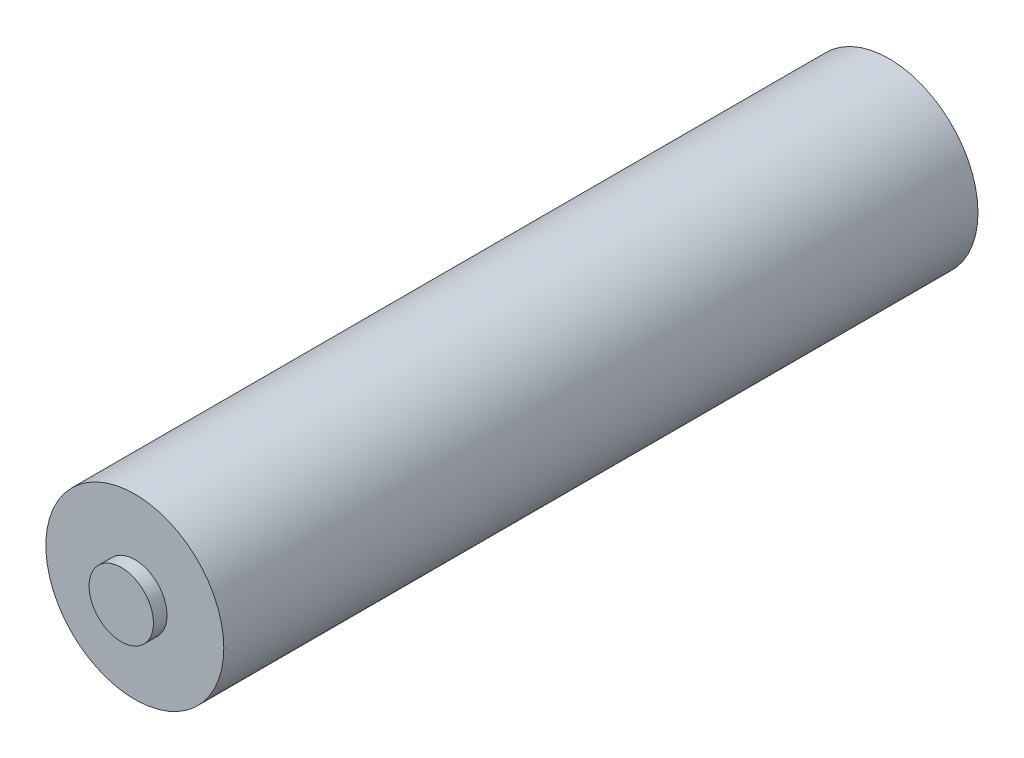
from build123d import *

# Parameters (mm, degrees)
SKETCH1_R      = 5.25
EXTRUDE1_DEPTH = 22.25
SKETCH2_R      = 1.89992
EXTRUDE2_DEPTH = 0.799846


with BuildPart() as part:
    # Sketch1 → Extrude1 (new, symmetric)
    with BuildSketch(Plane.XY):
        Circle(SKETCH1_R)
    extrude(amount=EXTRUDE1_DEPTH, both=True)

    # Sketch2 → Extrude2 (add)
    with BuildSketch(Plane.XY.offset(22.25)):
        with Locations(Location((0, 0, 0), (0, 0, 180))):
            Circle(SKETCH2_R)
    extrude(amount=EXTRUDE2_DEPTH)


solid = part.part
